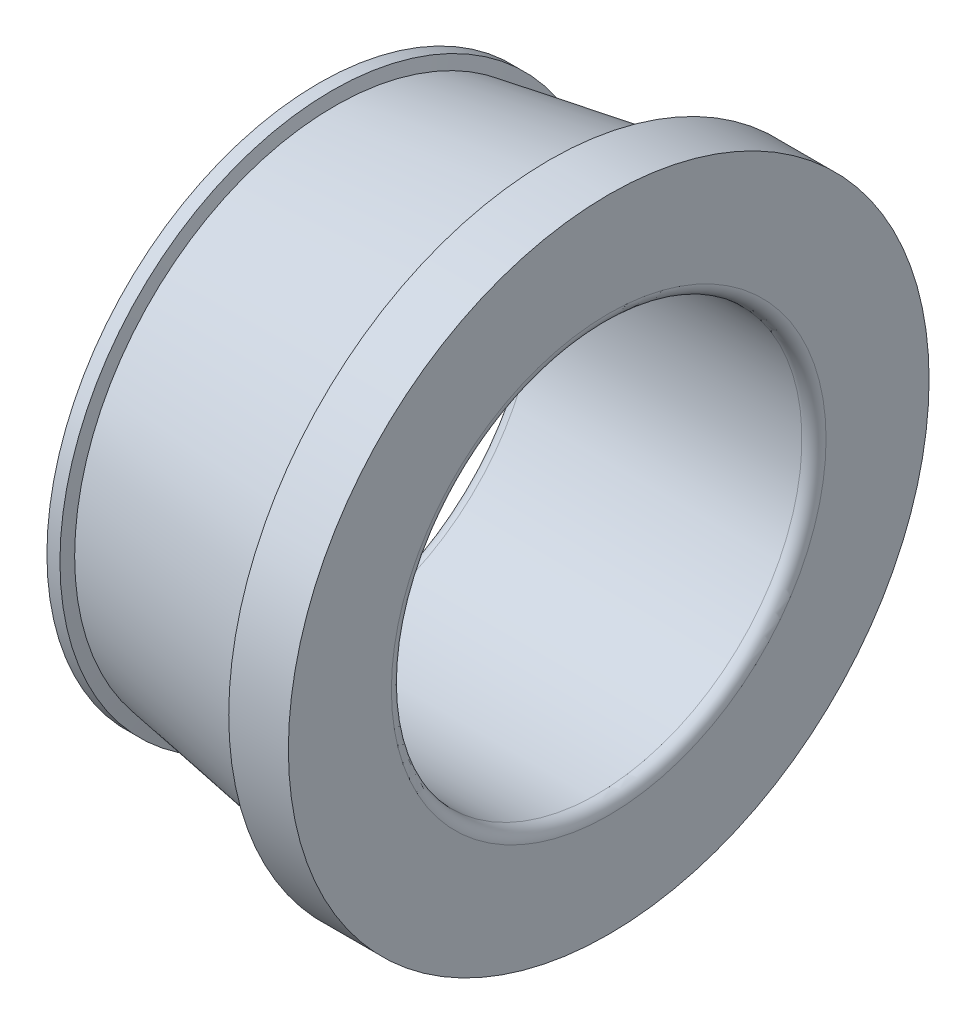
from build123d import *


with BuildPart() as part:
    # Esquisse1 → Base-R_volution (revolve)
    with BuildSketch(Plane(origin=(0, 0, 0), x_dir=(1, 0, 0), z_dir=(0, 1, 0)), mode=Mode.PRIVATE) as base_r_volution_sk:
        with BuildLine():
            Line((12.75, 8.5), (1.75, 8.5))
            ThreePointArc((1.75, 8.5), (1.396446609, 8.646446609), (1.25, 9))
            Line((1.25, 9), (1.25, 11.264405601))
            Line((1.25, 11.264405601), (1.788793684, 11.264405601))
            Line((1.788793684, 11.264405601), (1.898442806, 10.764405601))
            Line((1.898442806, 10.764405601), (11, 12.266109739))
            Line((11, 12.266109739), (10.780701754, 13.266109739))
            Line((10.780701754, 13.266109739), (13.25, 13.266109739))
            Line((13.25, 13.266109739), (13.25, 9))
            ThreePointArc((13.25, 9), (13.103553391, 8.646446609), (12.75, 8.5))
        make_face()
    revolve(base_r_volution_sk.sketch.rotate(Axis((0, 0, 0), (1, 0, 0)), 180), axis=Axis((0, 0, 0), (1, 0, 0)))


solid = part.part
